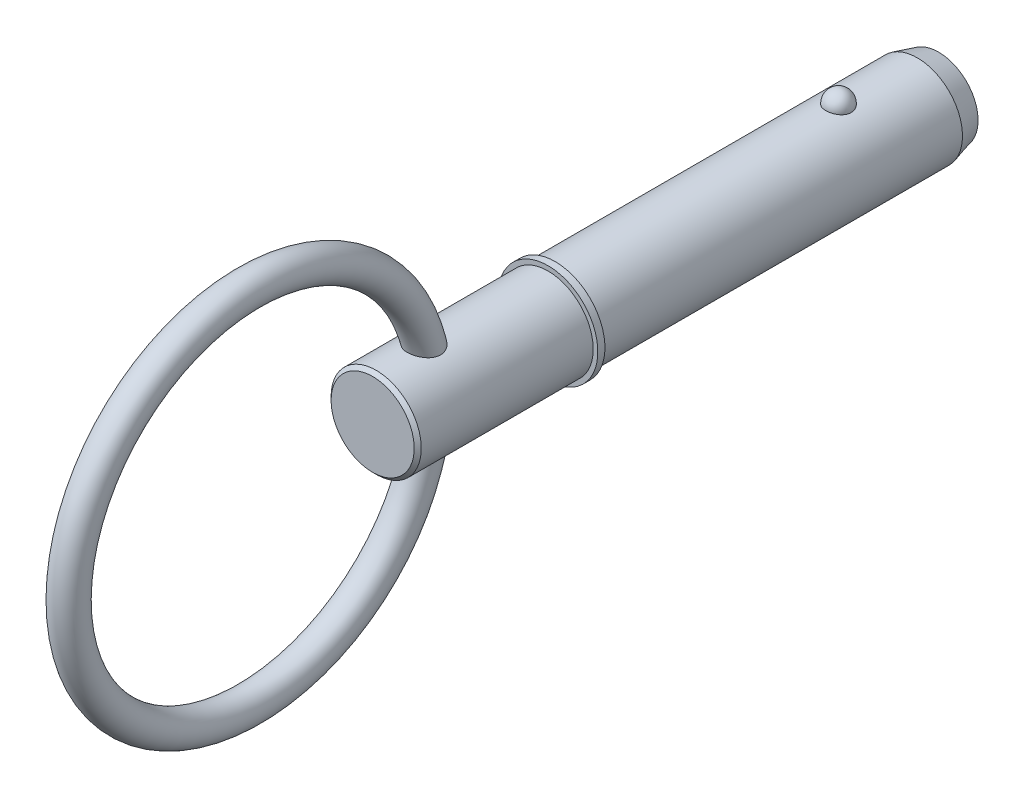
from build123d import *

# Parameters (mm, degrees)
SKETCH2_R           = 6.35
BOSS_EXTRUDE1_DEPTH = 38.1
BOSS_EXTRUDE2_START = 15.88
SKETCH3_R           = 6.35
BOSS_EXTRUDE2_DEPTH = 15.88
CHAMFER1_SIZE       = 3
CHAMFER1_SIZE2      = 0.803847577
SKETCH20_W          = 1
SKETCH20_H          = 7
SKETCH21_R          = 6.35
BOSS_EXTRUDE3_DEPTH = 25.7
CHAMFER2_SIZE       = 0.5
SKETCH24_R          = 2.25


with BuildPart() as part:
    # Sketch2 → Boss-Extrude1 (new body)
    with BuildSketch(Plane.XY):
        with Locations(Location((0, 0, 0), (0, 0, 180))):
            Circle(SKETCH2_R)
    extrude(amount=BOSS_EXTRUDE1_DEPTH)

    # Sketch3 → Boss-Extrude2 (add)
    with BuildSketch(Plane(origin=(0, 0, 0), x_dir=(-1, 0, 0), z_dir=(0, 0, -1)).offset(BOSS_EXTRUDE2_START)):
        Circle(SKETCH3_R)
    extrude(amount=-BOSS_EXTRUDE2_DEPTH)

    # Chamfer1
    chamfer1_edges = [part.edges().sort_by_distance(p)[0] for p in [
        (6.35, 0, -15.88),
    ]]
    chamfer1_side = [part.faces().sort_by_distance(p)[0] for p in [
        (6.35, 0, 11.11),
    ]]
    chamfer(chamfer1_edges, length=CHAMFER1_SIZE, length2=CHAMFER1_SIZE2, reference=chamfer1_side[0])

    # Sketch18 → Revolve1 (revolve)
    with BuildSketch(Plane(origin=(0, 0, 0), x_dir=(0, 0, -1), z_dir=(1, 0, 0))):
        with BuildLine():
            Line((1.78, 8.13), (1.78, 4.57))
            ThreePointArc((1.78, 4.57), (0, 6.35), (1.78, 8.13))
        make_face()
    revolve(axis=Axis((0, 8.13, -1.78), (0, -1, 0)))

    # Sketch20 → Revolve2 (revolve)
    with BuildSketch(Plane(origin=(0, 0, 0), x_dir=(0, 0, -1), z_dir=(1, 0, 0)), mode=Mode.PRIVATE) as revolve2_sk:
        with Locations((-38.6, 3.5)):
            Rectangle(SKETCH20_W, SKETCH20_H)
    revolve(revolve2_sk.sketch.rotate(Axis((0, 0, 33.728787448), (0, 0, 1)), 90), axis=Axis((0, 0, 33.728787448), (0, 0, 1)))

    # Sketch21 → Boss-Extrude3 (add)
    with BuildSketch(Plane(origin=(0, 0, 38.1), x_dir=(-1, 0, 0), z_dir=(0, 0, -1))):
        Circle(SKETCH21_R)
    extrude(amount=-BOSS_EXTRUDE3_DEPTH)

    # Chamfer2
    chamfer2_edges = [part.edges().sort_by_distance(p)[0] for p in [
        (6.35, 0, 63.8),
    ]]
    chamfer(chamfer2_edges, length=CHAMFER2_SIZE)

    # Sweep1: sweep along a path in Sketch23
    with BuildLine(Plane(origin=(0, 0, 0), x_dir=(0, 0, -1), z_dir=(1, 0, 0))) as sweep1_path:
        CenterArc((-81.2, 0), 25.4, 0, 360)
    # Sketch24 → Sweep1 (sweep)
    with BuildSketch(Plane(origin=(0, 0, 0), x_dir=(1, 0, 0), z_dir=(0, 1, 0))):
        with Locations((0, -55.8)):
            Circle(SKETCH24_R)
    sweep(path=sweep1_path.line)


solid = part.part
